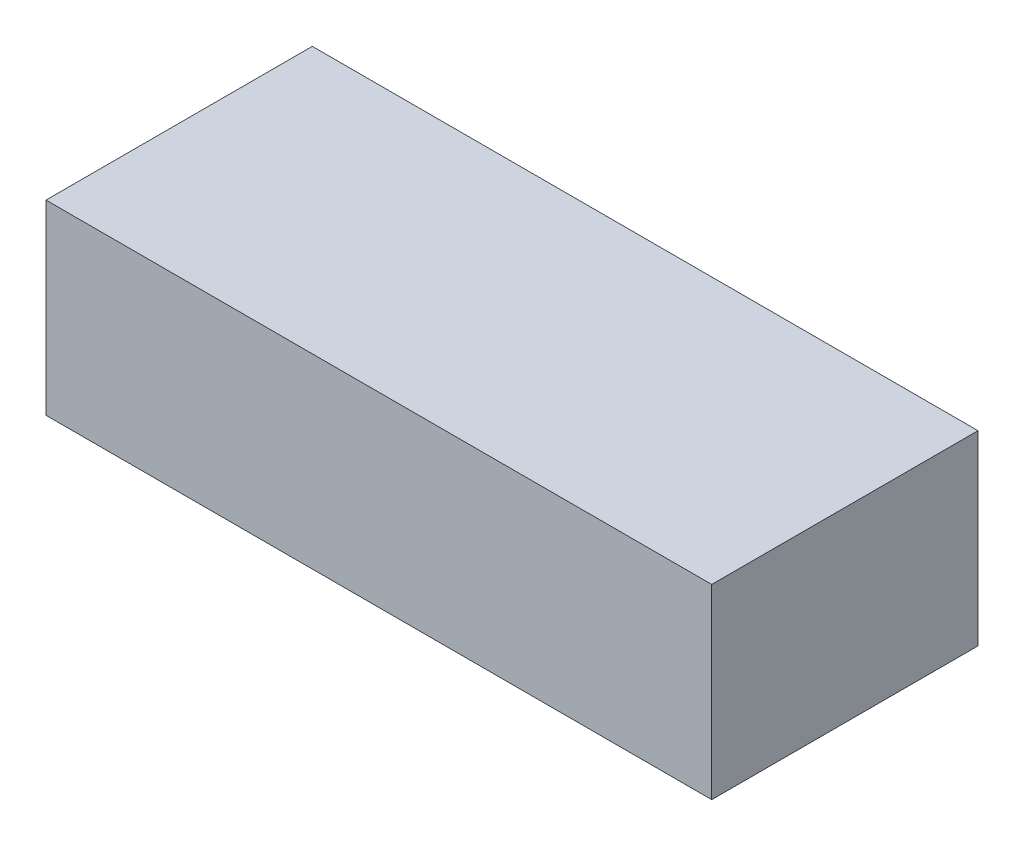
from build123d import *

# Parameters (mm, degrees)
SKETCH_1_W      = 125
SKETCH_1_H      = 35
EXTRUDE_1_DEPTH = 50


with BuildPart() as part:
    # Sketch 1 → Extrude 1 (new body)
    with BuildSketch(Plane.XY):
        Rectangle(SKETCH_1_W, SKETCH_1_H)
    extrude(amount=EXTRUDE_1_DEPTH)


solid = part.part
